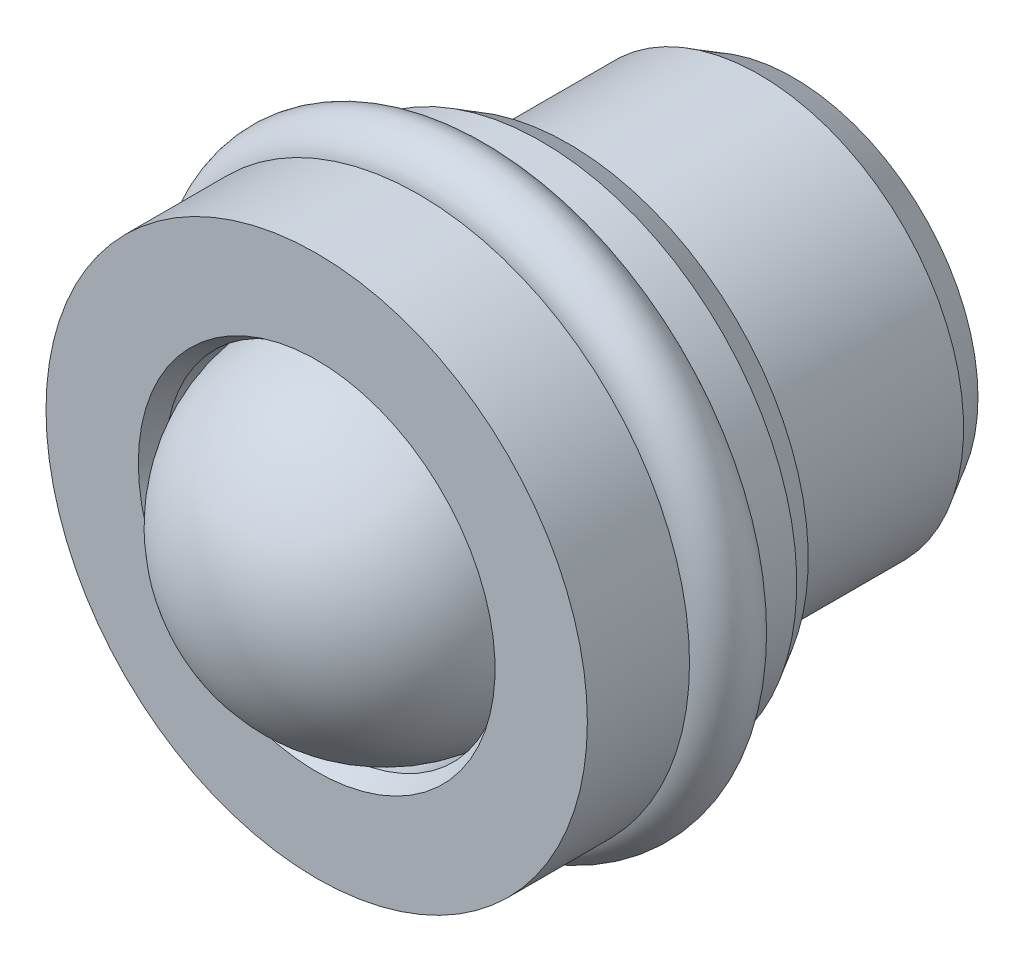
ISO-10303-21;
HEADER;
FILE_DESCRIPTION(('STEP AP214'),'2;1');
FILE_NAME('part.step','',(''),(''),'','','');
FILE_SCHEMA(('AUTOMOTIVE_DESIGN { 1 0 10303 214 1 1 1 1 }'));
ENDSEC;
DATA;
#1=APPLICATION_CONTEXT('core data for automotive mechanical design processes');
#2=APPLICATION_PROTOCOL_DEFINITION('international standard','automotive_design',2000,#1);
#3=PRODUCT_CONTEXT('',#1,'mechanical');
#4=PRODUCT('Part','Part','',(#3));
#5=PRODUCT_RELATED_PRODUCT_CATEGORY('part','',(#4));
#6=PRODUCT_DEFINITION_FORMATION('','',#4);
#7=PRODUCT_DEFINITION_CONTEXT('part definition',#1,'design');
#8=PRODUCT_DEFINITION('design','',#6,#7);
#9=PRODUCT_DEFINITION_SHAPE('','',#8);
#10=(LENGTH_UNIT() NAMED_UNIT(*) SI_UNIT(.MILLI.,.METRE.));
#11=(NAMED_UNIT(*) PLANE_ANGLE_UNIT() SI_UNIT($,.RADIAN.));
#12=(NAMED_UNIT(*) SI_UNIT($,.STERADIAN.) SOLID_ANGLE_UNIT());
#13=UNCERTAINTY_MEASURE_WITH_UNIT(LENGTH_MEASURE(1.E-05),#10,'distance_accuracy_value','');
#14=(GEOMETRIC_REPRESENTATION_CONTEXT(3) GLOBAL_UNCERTAINTY_ASSIGNED_CONTEXT((#13)) GLOBAL_UNIT_ASSIGNED_CONTEXT((#10,
#11,#12)) REPRESENTATION_CONTEXT('',''));
#15=CARTESIAN_POINT('',(0.,0.,0.));
#16=DIRECTION('',(0.,0.,1.));
#17=DIRECTION('',(1.,0.,0.));
#18=AXIS2_PLACEMENT_3D('',#15,#16,#17);
#19=CARTESIAN_POINT('',(0.,0.,-2.8));
#20=DIRECTION('',(0.,0.,1.));
#21=DIRECTION('',(1.,0.,0.));
#22=AXIS2_PLACEMENT_3D('',#19,#20,#21);
#23=CONICAL_SURFACE('',#22,3.,0.52359877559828);
#24=CARTESIAN_POINT('',(0.,0.,-3.3));
#25=DIRECTION('',(0.,0.,-1.));
#26=DIRECTION('',(-1.,0.,0.));
#27=AXIS2_PLACEMENT_3D('',#24,#25,#26);
#28=CIRCLE('',#27,2.7113248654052);
#29=CARTESIAN_POINT('',(-2.7113248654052,0.,-3.3));
#30=VERTEX_POINT('',#29);
#31=EDGE_CURVE('E18',#30,#30,#28,.T.);
#32=ORIENTED_EDGE('',*,*,#31,.F.);
#33=EDGE_LOOP('',(#32));
#34=FACE_BOUND('',#33,.T.);
#35=CARTESIAN_POINT('',(0.,0.,-2.8));
#36=DIRECTION('',(0.,0.,-1.));
#37=DIRECTION('',(-1.,0.,0.));
#38=AXIS2_PLACEMENT_3D('',#35,#36,#37);
#39=CIRCLE('',#38,3.);
#40=CARTESIAN_POINT('',(-3.,0.,-2.8));
#41=VERTEX_POINT('',#40);
#42=EDGE_CURVE('E70',#41,#41,#39,.T.);
#43=ORIENTED_EDGE('',*,*,#42,.T.);
#44=EDGE_LOOP('',(#43));
#45=FACE_BOUND('',#44,.T.);
#46=ADVANCED_FACE('F12',(#34,#45),#23,.T.);
#47=CARTESIAN_POINT('',(0.,2.7113248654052,-3.3));
#48=DIRECTION('',(0.,0.,1.));
#49=DIRECTION('',(1.,0.,0.));
#50=AXIS2_PLACEMENT_3D('',#47,#48,#49);
#51=PLANE('',#50);
#52=ORIENTED_EDGE('',*,*,#31,.T.);
#53=EDGE_LOOP('',(#52));
#54=FACE_BOUND('',#53,.T.);
#55=ADVANCED_FACE('F168',(#54),#51,.F.);
#56=CARTESIAN_POINT('',(0.,0.,3.7));
#57=DIRECTION('',(0.,0.,-1.));
#58=DIRECTION('',(-1.,0.,0.));
#59=AXIS2_PLACEMENT_3D('',#56,#57,#58);
#60=CYLINDRICAL_SURFACE('',#59,2.475);
#61=CARTESIAN_POINT('',(0.,0.,3.05266839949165));
#62=DIRECTION('',(0.,0.,-1.));
#63=DIRECTION('',(-1.,0.,0.));
#64=AXIS2_PLACEMENT_3D('',#61,#62,#63);
#65=CIRCLE('',#64,2.475);
#66=CARTESIAN_POINT('',(-2.475,0.,3.05266839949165));
#67=VERTEX_POINT('',#66);
#68=EDGE_CURVE('E8',#67,#67,#65,.T.);
#69=ORIENTED_EDGE('',*,*,#68,.T.);
#70=EDGE_LOOP('',(#69));
#71=FACE_BOUND('',#70,.T.);
#72=CARTESIAN_POINT('',(0.,0.,3.45));
#73=DIRECTION('',(0.,0.,-1.));
#74=DIRECTION('',(-1.,0.,0.));
#75=AXIS2_PLACEMENT_3D('',#72,#73,#74);
#76=CIRCLE('',#75,2.475);
#77=CARTESIAN_POINT('',(-2.475,0.,3.45));
#78=VERTEX_POINT('',#77);
#79=EDGE_CURVE('E22',#78,#78,#76,.T.);
#80=ORIENTED_EDGE('',*,*,#79,.F.);
#81=EDGE_LOOP('',(#80));
#82=FACE_BOUND('',#81,.T.);
#83=ADVANCED_FACE('F163',(#71,#82),#60,.F.);
#84=CARTESIAN_POINT('',(0.,0.,3.45));
#85=DIRECTION('',(0.,0.,1.));
#86=DIRECTION('',(1.,0.,0.));
#87=AXIS2_PLACEMENT_3D('',#84,#85,#86);
#88=CONICAL_SURFACE('',#87,2.475,0.523598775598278);
#89=CARTESIAN_POINT('',(0.,0.,3.7));
#90=DIRECTION('',(0.,0.,-1.));
#91=DIRECTION('',(-1.,0.,0.));
#92=AXIS2_PLACEMENT_3D('',#89,#90,#91);
#93=CIRCLE('',#92,2.6193375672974);
#94=CARTESIAN_POINT('',(-2.6193375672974,0.,3.7));
#95=VERTEX_POINT('',#94);
#96=EDGE_CURVE('E26',#95,#95,#93,.T.);
#97=ORIENTED_EDGE('',*,*,#96,.F.);
#98=EDGE_LOOP('',(#97));
#99=FACE_BOUND('',#98,.T.);
#100=ORIENTED_EDGE('',*,*,#79,.T.);
#101=EDGE_LOOP('',(#100));
#102=FACE_BOUND('',#101,.T.);
#103=ADVANCED_FACE('F157',(#99,#102),#88,.F.);
#104=CARTESIAN_POINT('',(0.,2.6193375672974,3.7));
#105=DIRECTION('',(0.,0.,-1.));
#106=DIRECTION('',(-1.,0.,0.));
#107=AXIS2_PLACEMENT_3D('',#104,#105,#106);
#108=PLANE('',#107);
#109=CARTESIAN_POINT('',(0.,0.,3.7));
#110=DIRECTION('',(0.,0.,-1.));
#111=DIRECTION('',(-1.,0.,0.));
#112=AXIS2_PLACEMENT_3D('',#109,#110,#111);
#113=CIRCLE('',#112,3.975);
#114=CARTESIAN_POINT('',(-3.975,0.,3.7));
#115=VERTEX_POINT('',#114);
#116=EDGE_CURVE('E31',#115,#115,#113,.T.);
#117=ORIENTED_EDGE('',*,*,#116,.F.);
#118=EDGE_LOOP('',(#117));
#119=FACE_BOUND('',#118,.T.);
#120=ORIENTED_EDGE('',*,*,#96,.T.);
#121=EDGE_LOOP('',(#120));
#122=FACE_BOUND('',#121,.T.);
#123=ADVANCED_FACE('F151',(#119,#122),#108,.F.);
#124=CARTESIAN_POINT('',(0.,0.,3.7));
#125=DIRECTION('',(0.,0.,-1.));
#126=DIRECTION('',(-1.,0.,0.));
#127=AXIS2_PLACEMENT_3D('',#124,#125,#126);
#128=CYLINDRICAL_SURFACE('',#127,3.975);
#129=CARTESIAN_POINT('',(0.,0.,2.2));
#130=DIRECTION('',(0.,0.,-1.));
#131=DIRECTION('',(-1.,0.,0.));
#132=AXIS2_PLACEMENT_3D('',#129,#130,#131);
#133=CIRCLE('',#132,3.975);
#134=CARTESIAN_POINT('',(-3.975,0.,2.2));
#135=VERTEX_POINT('',#134);
#136=EDGE_CURVE('E34',#135,#135,#133,.T.);
#137=ORIENTED_EDGE('',*,*,#136,.F.);
#138=EDGE_LOOP('',(#137));
#139=FACE_BOUND('',#138,.T.);
#140=ORIENTED_EDGE('',*,*,#116,.T.);
#141=EDGE_LOOP('',(#140));
#142=FACE_BOUND('',#141,.T.);
#143=ADVANCED_FACE('F145',(#139,#142),#128,.T.);
#144=CARTESIAN_POINT('',(0.,3.975,2.2));
#145=DIRECTION('',(0.,0.,1.));
#146=DIRECTION('',(1.,0.,0.));
#147=AXIS2_PLACEMENT_3D('',#144,#145,#146);
#148=PLANE('',#147);
#149=CARTESIAN_POINT('',(0.,0.,2.2));
#150=DIRECTION('',(0.,0.,-1.));
#151=DIRECTION('',(-1.,0.,0.));
#152=AXIS2_PLACEMENT_3D('',#149,#150,#151);
#153=CIRCLE('',#152,3.3);
#154=CARTESIAN_POINT('',(-3.3,0.,2.2));
#155=VERTEX_POINT('',#154);
#156=EDGE_CURVE('E37',#155,#155,#153,.T.);
#157=ORIENTED_EDGE('',*,*,#156,.F.);
#158=EDGE_LOOP('',(#157));
#159=FACE_BOUND('',#158,.T.);
#160=ORIENTED_EDGE('',*,*,#136,.T.);
#161=EDGE_LOOP('',(#160));
#162=FACE_BOUND('',#161,.T.);
#163=ADVANCED_FACE('F139',(#159,#162),#148,.F.);
#164=CARTESIAN_POINT('',(0.,0.,3.7));
#165=DIRECTION('',(0.,0.,-1.));
#166=DIRECTION('',(-1.,0.,0.));
#167=AXIS2_PLACEMENT_3D('',#164,#165,#166);
#168=CYLINDRICAL_SURFACE('',#167,3.3);
#169=CARTESIAN_POINT('',(0.,0.,2.1));
#170=DIRECTION('',(0.,0.,-1.));
#171=DIRECTION('',(-1.,0.,0.));
#172=AXIS2_PLACEMENT_3D('',#169,#170,#171);
#173=CIRCLE('',#172,3.3);
#174=CARTESIAN_POINT('',(-3.3,0.,2.1));
#175=VERTEX_POINT('',#174);
#176=EDGE_CURVE('E40',#175,#175,#173,.T.);
#177=ORIENTED_EDGE('',*,*,#176,.F.);
#178=EDGE_LOOP('',(#177));
#179=FACE_BOUND('',#178,.T.);
#180=ORIENTED_EDGE('',*,*,#156,.T.);
#181=EDGE_LOOP('',(#180));
#182=FACE_BOUND('',#181,.T.);
#183=ADVANCED_FACE('F133',(#179,#182),#168,.T.);
#184=CARTESIAN_POINT('',(0.,3.3,2.1));
#185=DIRECTION('',(0.,0.,-1.));
#186=DIRECTION('',(-1.,0.,0.));
#187=AXIS2_PLACEMENT_3D('',#184,#185,#186);
#188=PLANE('',#187);
#189=CARTESIAN_POINT('',(0.,0.,2.1));
#190=DIRECTION('',(0.,0.,-1.));
#191=DIRECTION('',(-1.,0.,0.));
#192=AXIS2_PLACEMENT_3D('',#189,#190,#191);
#193=CIRCLE('',#192,3.8);
#194=CARTESIAN_POINT('',(-3.8,0.,2.1));
#195=VERTEX_POINT('',#194);
#196=EDGE_CURVE('E43',#195,#195,#193,.T.);
#197=ORIENTED_EDGE('',*,*,#196,.F.);
#198=EDGE_LOOP('',(#197));
#199=FACE_BOUND('',#198,.T.);
#200=ORIENTED_EDGE('',*,*,#176,.T.);
#201=EDGE_LOOP('',(#200));
#202=FACE_BOUND('',#201,.T.);
#203=ADVANCED_FACE('F127',(#199,#202),#188,.F.);
#204=CARTESIAN_POINT('',(0.,0.,1.59999999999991));
#205=DIRECTION('',(0.,0.,-1.));
#206=DIRECTION('',(-1.,0.,0.));
#207=AXIS2_PLACEMENT_3D('',#204,#205,#206);
#208=TOROIDAL_SURFACE('',#207,3.80000000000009,0.499999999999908);
#209=CARTESIAN_POINT('',(0.,0.,1.1));
#210=DIRECTION('',(0.,0.,-1.));
#211=DIRECTION('',(-1.,0.,0.));
#212=AXIS2_PLACEMENT_3D('',#209,#210,#211);
#213=CIRCLE('',#212,3.8);
#214=CARTESIAN_POINT('',(-3.8,0.,1.1));
#215=VERTEX_POINT('',#214);
#216=EDGE_CURVE('E46',#215,#215,#213,.T.);
#217=ORIENTED_EDGE('',*,*,#216,.F.);
#218=EDGE_LOOP('',(#217));
#219=FACE_BOUND('',#218,.T.);
#220=ORIENTED_EDGE('',*,*,#196,.T.);
#221=EDGE_LOOP('',(#220));
#222=FACE_BOUND('',#221,.T.);
#223=ADVANCED_FACE('F121',(#219,#222),#208,.T.);
#224=CARTESIAN_POINT('',(0.,3.8,1.1));
#225=DIRECTION('',(0.,0.,1.));
#226=DIRECTION('',(1.,0.,0.));
#227=AXIS2_PLACEMENT_3D('',#224,#225,#226);
#228=PLANE('',#227);
#229=CARTESIAN_POINT('',(0.,0.,1.1));
#230=DIRECTION('',(0.,0.,-1.));
#231=DIRECTION('',(-1.,0.,0.));
#232=AXIS2_PLACEMENT_3D('',#229,#230,#231);
#233=CIRCLE('',#232,3.3);
#234=CARTESIAN_POINT('',(-3.3,0.,1.1));
#235=VERTEX_POINT('',#234);
#236=EDGE_CURVE('E49',#235,#235,#233,.T.);
#237=ORIENTED_EDGE('',*,*,#236,.F.);
#238=EDGE_LOOP('',(#237));
#239=FACE_BOUND('',#238,.T.);
#240=ORIENTED_EDGE('',*,*,#216,.T.);
#241=EDGE_LOOP('',(#240));
#242=FACE_BOUND('',#241,.T.);
#243=ADVANCED_FACE('F115',(#239,#242),#228,.F.);
#244=CARTESIAN_POINT('',(0.,0.,3.7));
#245=DIRECTION('',(0.,0.,-1.));
#246=DIRECTION('',(-1.,0.,0.));
#247=AXIS2_PLACEMENT_3D('',#244,#245,#246);
#248=CYLINDRICAL_SURFACE('',#247,3.3);
#249=CARTESIAN_POINT('',(0.,0.,1.));
#250=DIRECTION('',(0.,0.,-1.));
#251=DIRECTION('',(-1.,0.,0.));
#252=AXIS2_PLACEMENT_3D('',#249,#250,#251);
#253=CIRCLE('',#252,3.3);
#254=CARTESIAN_POINT('',(-3.3,0.,1.));
#255=VERTEX_POINT('',#254);
#256=EDGE_CURVE('E52',#255,#255,#253,.T.);
#257=ORIENTED_EDGE('',*,*,#256,.F.);
#258=EDGE_LOOP('',(#257));
#259=FACE_BOUND('',#258,.T.);
#260=ORIENTED_EDGE('',*,*,#236,.T.);
#261=EDGE_LOOP('',(#260));
#262=FACE_BOUND('',#261,.T.);
#263=ADVANCED_FACE('F109',(#259,#262),#248,.T.);
#264=CARTESIAN_POINT('',(0.,3.3,1.));
#265=DIRECTION('',(0.,0.,-1.));
#266=DIRECTION('',(-1.,0.,0.));
#267=AXIS2_PLACEMENT_3D('',#264,#265,#266);
#268=PLANE('',#267);
#269=CARTESIAN_POINT('',(0.,0.,1.));
#270=DIRECTION('',(0.,0.,-1.));
#271=DIRECTION('',(-1.,0.,0.));
#272=AXIS2_PLACEMENT_3D('',#269,#270,#271);
#273=CIRCLE('',#272,3.75);
#274=CARTESIAN_POINT('',(-3.75,0.,1.));
#275=VERTEX_POINT('',#274);
#276=EDGE_CURVE('E55',#275,#275,#273,.T.);
#277=ORIENTED_EDGE('',*,*,#276,.F.);
#278=EDGE_LOOP('',(#277));
#279=FACE_BOUND('',#278,.T.);
#280=ORIENTED_EDGE('',*,*,#256,.T.);
#281=EDGE_LOOP('',(#280));
#282=FACE_BOUND('',#281,.T.);
#283=ADVANCED_FACE('F103',(#279,#282),#268,.F.);
#284=CARTESIAN_POINT('',(0.,0.,3.7));
#285=DIRECTION('',(0.,0.,-1.));
#286=DIRECTION('',(-1.,0.,0.));
#287=AXIS2_PLACEMENT_3D('',#284,#285,#286);
#288=CYLINDRICAL_SURFACE('',#287,3.75);
#289=CARTESIAN_POINT('',(0.,0.,0.4));
#290=DIRECTION('',(0.,0.,-1.));
#291=DIRECTION('',(-1.,0.,0.));
#292=AXIS2_PLACEMENT_3D('',#289,#290,#291);
#293=CIRCLE('',#292,3.75);
#294=CARTESIAN_POINT('',(-3.75,0.,0.4));
#295=VERTEX_POINT('',#294);
#296=EDGE_CURVE('E58',#295,#295,#293,.T.);
#297=ORIENTED_EDGE('',*,*,#296,.F.);
#298=EDGE_LOOP('',(#297));
#299=FACE_BOUND('',#298,.T.);
#300=ORIENTED_EDGE('',*,*,#276,.T.);
#301=EDGE_LOOP('',(#300));
#302=FACE_BOUND('',#301,.T.);
#303=ADVANCED_FACE('F97',(#299,#302),#288,.T.);
#304=CARTESIAN_POINT('',(0.,0.,0.4));
#305=DIRECTION('',(0.,0.,1.));
#306=DIRECTION('',(1.,0.,0.));
#307=AXIS2_PLACEMENT_3D('',#304,#305,#306);
#308=CONICAL_SURFACE('',#307,3.75,0.523598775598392);
#309=CARTESIAN_POINT('',(0.,0.,0.));
#310=DIRECTION('',(0.,0.,-1.));
#311=DIRECTION('',(-1.,0.,0.));
#312=AXIS2_PLACEMENT_3D('',#309,#310,#311);
#313=CIRCLE('',#312,3.5190598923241);
#314=CARTESIAN_POINT('',(-3.5190598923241,0.,0.));
#315=VERTEX_POINT('',#314);
#316=EDGE_CURVE('E61',#315,#315,#313,.T.);
#317=ORIENTED_EDGE('',*,*,#316,.F.);
#318=EDGE_LOOP('',(#317));
#319=FACE_BOUND('',#318,.T.);
#320=ORIENTED_EDGE('',*,*,#296,.T.);
#321=EDGE_LOOP('',(#320));
#322=FACE_BOUND('',#321,.T.);
#323=ADVANCED_FACE('F91',(#319,#322),#308,.T.);
#324=CARTESIAN_POINT('',(0.,3.5190598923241,0.));
#325=DIRECTION('',(0.,0.,1.));
#326=DIRECTION('',(1.,0.,0.));
#327=AXIS2_PLACEMENT_3D('',#324,#325,#326);
#328=PLANE('',#327);
#329=CARTESIAN_POINT('',(0.,0.,0.));
#330=DIRECTION('',(0.,0.,-1.));
#331=DIRECTION('',(-1.,0.,0.));
#332=AXIS2_PLACEMENT_3D('',#329,#330,#331);
#333=CIRCLE('',#332,3.2);
#334=CARTESIAN_POINT('',(-3.2,0.,0.));
#335=VERTEX_POINT('',#334);
#336=EDGE_CURVE('E64',#335,#335,#333,.T.);
#337=ORIENTED_EDGE('',*,*,#336,.F.);
#338=EDGE_LOOP('',(#337));
#339=FACE_BOUND('',#338,.T.);
#340=ORIENTED_EDGE('',*,*,#316,.T.);
#341=EDGE_LOOP('',(#340));
#342=FACE_BOUND('',#341,.T.);
#343=ADVANCED_FACE('F85',(#339,#342),#328,.F.);
#344=CARTESIAN_POINT('',(0.,0.,-0.2));
#345=DIRECTION('',(0.,0.,-1.));
#346=DIRECTION('',(-1.,0.,0.));
#347=AXIS2_PLACEMENT_3D('',#344,#345,#346);
#348=TOROIDAL_SURFACE('',#347,3.20000000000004,0.200000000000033);
#349=CARTESIAN_POINT('',(0.,0.,-0.2));
#350=DIRECTION('',(0.,0.,-1.));
#351=DIRECTION('',(-1.,0.,0.));
#352=AXIS2_PLACEMENT_3D('',#349,#350,#351);
#353=CIRCLE('',#352,3.);
#354=CARTESIAN_POINT('',(-3.,0.,-0.2));
#355=VERTEX_POINT('',#354);
#356=EDGE_CURVE('E67',#355,#355,#353,.T.);
#357=ORIENTED_EDGE('',*,*,#356,.F.);
#358=EDGE_LOOP('',(#357));
#359=FACE_BOUND('',#358,.T.);
#360=ORIENTED_EDGE('',*,*,#336,.T.);
#361=EDGE_LOOP('',(#360));
#362=FACE_BOUND('',#361,.T.);
#363=ADVANCED_FACE('F79',(#359,#362),#348,.F.);
#364=CARTESIAN_POINT('',(0.,0.,3.7));
#365=DIRECTION('',(0.,0.,-1.));
#366=DIRECTION('',(-1.,0.,0.));
#367=AXIS2_PLACEMENT_3D('',#364,#365,#366);
#368=CYLINDRICAL_SURFACE('',#367,3.);
#369=ORIENTED_EDGE('',*,*,#42,.F.);
#370=EDGE_LOOP('',(#369));
#371=FACE_BOUND('',#370,.T.);
#372=ORIENTED_EDGE('',*,*,#356,.T.);
#373=EDGE_LOOP('',(#372));
#374=FACE_BOUND('',#373,.T.);
#375=ADVANCED_FACE('F75',(#371,#374),#368,.T.);
#376=CARTESIAN_POINT('',(0.,0.,2.7));
#377=DIRECTION('',(0.,0.,-1.));
#378=DIRECTION('',(0.,-1.,0.));
#379=AXIS2_PLACEMENT_3D('',#376,#377,#378);
#380=SPHERICAL_SURFACE('',#379,2.5);
#381=ORIENTED_EDGE('',*,*,#68,.F.);
#382=EDGE_LOOP('',(#381));
#383=FACE_BOUND('',#382,.T.);
#384=ADVANCED_FACE('F78',(#383),#380,.T.);
#385=CLOSED_SHELL('',(#46,#55,#83,#103,#123,#143,#163,#183,#203,#223,#243,#263,#283,#303,#323,
#343,#363,#375,#384));
#386=MANIFOLD_SOLID_BREP('B1',#385);
#387=ADVANCED_BREP_SHAPE_REPRESENTATION('',(#18,#386),#14);
#388=SHAPE_DEFINITION_REPRESENTATION(#9,#387);
ENDSEC;
END-ISO-10303-21;
